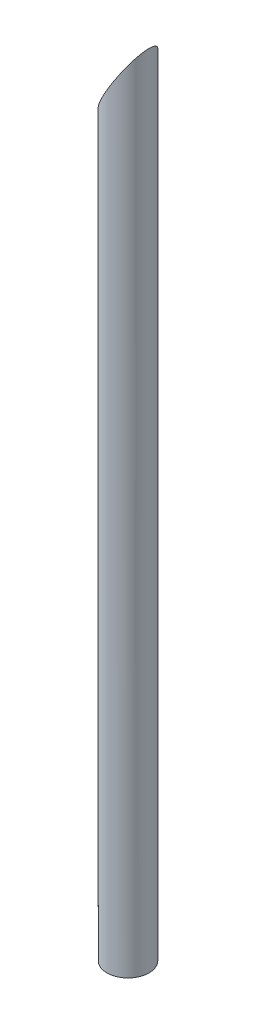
ISO-10303-21;
HEADER;
FILE_DESCRIPTION(('STEP AP214'),'2;1');
FILE_NAME('part.step','',(''),(''),'','','');
FILE_SCHEMA(('AUTOMOTIVE_DESIGN { 1 0 10303 214 1 1 1 1 }'));
ENDSEC;
DATA;
#1=APPLICATION_CONTEXT('core data for automotive mechanical design processes');
#2=APPLICATION_PROTOCOL_DEFINITION('international standard','automotive_design',2000,#1);
#3=PRODUCT_CONTEXT('',#1,'mechanical');
#4=PRODUCT('Part','Part','',(#3));
#5=PRODUCT_RELATED_PRODUCT_CATEGORY('part','',(#4));
#6=PRODUCT_DEFINITION_FORMATION('','',#4);
#7=PRODUCT_DEFINITION_CONTEXT('part definition',#1,'design');
#8=PRODUCT_DEFINITION('design','',#6,#7);
#9=PRODUCT_DEFINITION_SHAPE('','',#8);
#10=(LENGTH_UNIT() NAMED_UNIT(*) SI_UNIT(.MILLI.,.METRE.));
#11=(NAMED_UNIT(*) PLANE_ANGLE_UNIT() SI_UNIT($,.RADIAN.));
#12=(NAMED_UNIT(*) SI_UNIT($,.STERADIAN.) SOLID_ANGLE_UNIT());
#13=UNCERTAINTY_MEASURE_WITH_UNIT(LENGTH_MEASURE(1.E-05),#10,'distance_accuracy_value','');
#14=(GEOMETRIC_REPRESENTATION_CONTEXT(3) GLOBAL_UNCERTAINTY_ASSIGNED_CONTEXT((#13)) GLOBAL_UNIT_ASSIGNED_CONTEXT((#10,
#11,#12)) REPRESENTATION_CONTEXT('',''));
#15=CARTESIAN_POINT('',(0.,0.,0.));
#16=DIRECTION('',(0.,0.,1.));
#17=DIRECTION('',(1.,0.,0.));
#18=AXIS2_PLACEMENT_3D('',#15,#16,#17);
#19=CARTESIAN_POINT('',(0.,95.,0.));
#20=DIRECTION('',(0.,-1.,0.));
#21=DIRECTION('',(0.,0.,-1.));
#22=AXIS2_PLACEMENT_3D('',#19,#20,#21);
#23=CYLINDRICAL_SURFACE('',#22,2.5);
#24=CARTESIAN_POINT('',(0.,0.,0.));
#25=DIRECTION('',(0.,1.,0.));
#26=DIRECTION('',(0.,0.,1.));
#27=AXIS2_PLACEMENT_3D('',#24,#25,#26);
#28=CIRCLE('',#27,2.5);
#29=CARTESIAN_POINT('',(0.,0.,2.5));
#30=VERTEX_POINT('',#29);
#31=EDGE_CURVE('E10',#30,#30,#28,.T.);
#32=ORIENTED_EDGE('',*,*,#31,.T.);
#33=EDGE_LOOP('',(#32));
#34=FACE_BOUND('',#33,.T.);
#35=CARTESIAN_POINT('',(0.,90.7296713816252,0.));
#36=DIRECTION('',(-0.862988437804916,0.505223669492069,0.));
#37=DIRECTION('',(-0.505223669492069,-0.862988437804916,0.));
#38=AXIS2_PLACEMENT_3D('',#35,#36,#37);
#39=ELLIPSE('',#38,4.94830339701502,2.5);
#40=CARTESIAN_POINT('',(-2.5,86.4593427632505,0.));
#41=VERTEX_POINT('',#40);
#42=EDGE_CURVE('E48',#41,#41,#39,.T.);
#43=ORIENTED_EDGE('',*,*,#42,.F.);
#44=EDGE_LOOP('',(#43));
#45=FACE_BOUND('',#44,.T.);
#46=ADVANCED_FACE('F41',(#34,#45),#23,.T.);
#47=CARTESIAN_POINT('',(0.,0.,0.));
#48=DIRECTION('',(0.,1.,0.));
#49=DIRECTION('',(0.,0.,1.));
#50=AXIS2_PLACEMENT_3D('',#47,#48,#49);
#51=PLANE('',#50);
#52=ORIENTED_EDGE('',*,*,#31,.F.);
#53=EDGE_LOOP('',(#52));
#54=FACE_BOUND('',#53,.T.);
#55=ADVANCED_FACE('F58',(#54),#51,.F.);
#56=CARTESIAN_POINT('',(2.5,95.,95.));
#57=DIRECTION('',(-0.862988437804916,0.505223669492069,0.));
#58=DIRECTION('',(-0.505223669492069,-0.862988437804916,0.));
#59=AXIS2_PLACEMENT_3D('',#56,#57,#58);
#60=PLANE('',#59);
#61=ORIENTED_EDGE('',*,*,#42,.T.);
#62=EDGE_LOOP('',(#61));
#63=FACE_BOUND('',#62,.T.);
#64=ADVANCED_FACE('F55',(#63),#60,.T.);
#65=CLOSED_SHELL('',(#46,#55,#64));
#66=MANIFOLD_SOLID_BREP('B2',#65);
#67=ADVANCED_BREP_SHAPE_REPRESENTATION('',(#18,#66),#14);
#68=SHAPE_DEFINITION_REPRESENTATION(#9,#67);
ENDSEC;
END-ISO-10303-21;
